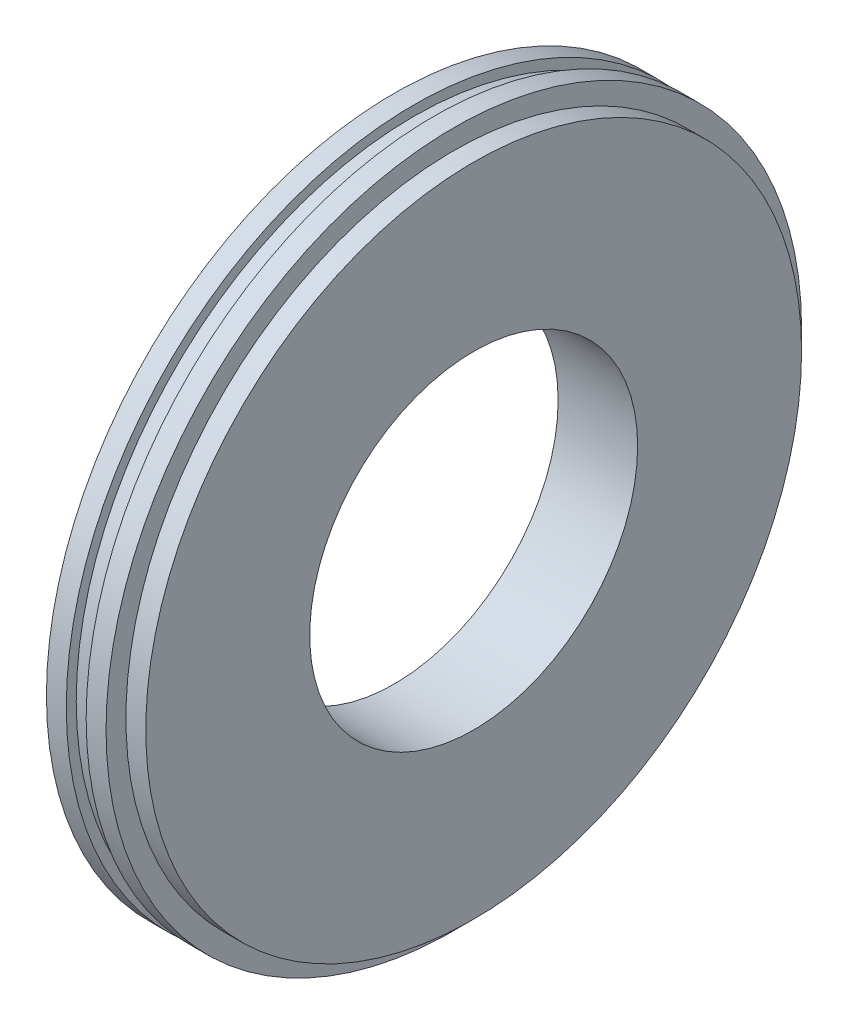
ISO-10303-21;
HEADER;
FILE_DESCRIPTION(('STEP AP214'),'2;1');
FILE_NAME('part.step','',(''),(''),'','','');
FILE_SCHEMA(('AUTOMOTIVE_DESIGN { 1 0 10303 214 1 1 1 1 }'));
ENDSEC;
DATA;
#1=APPLICATION_CONTEXT('core data for automotive mechanical design processes');
#2=APPLICATION_PROTOCOL_DEFINITION('international standard','automotive_design',2000,#1);
#3=PRODUCT_CONTEXT('',#1,'mechanical');
#4=PRODUCT('Part','Part','',(#3));
#5=PRODUCT_RELATED_PRODUCT_CATEGORY('part','',(#4));
#6=PRODUCT_DEFINITION_FORMATION('','',#4);
#7=PRODUCT_DEFINITION_CONTEXT('part definition',#1,'design');
#8=PRODUCT_DEFINITION('design','',#6,#7);
#9=PRODUCT_DEFINITION_SHAPE('','',#8);
#10=(LENGTH_UNIT() NAMED_UNIT(*) SI_UNIT(.MILLI.,.METRE.));
#11=(NAMED_UNIT(*) PLANE_ANGLE_UNIT() SI_UNIT($,.RADIAN.));
#12=(NAMED_UNIT(*) SI_UNIT($,.STERADIAN.) SOLID_ANGLE_UNIT());
#13=UNCERTAINTY_MEASURE_WITH_UNIT(LENGTH_MEASURE(1.E-05),#10,'distance_accuracy_value','');
#14=(GEOMETRIC_REPRESENTATION_CONTEXT(3) GLOBAL_UNCERTAINTY_ASSIGNED_CONTEXT((#13)) GLOBAL_UNIT_ASSIGNED_CONTEXT((#10,
#11,#12)) REPRESENTATION_CONTEXT('',''));
#15=CARTESIAN_POINT('',(0.,0.,0.));
#16=DIRECTION('',(0.,0.,1.));
#17=DIRECTION('',(1.,0.,0.));
#18=AXIS2_PLACEMENT_3D('',#15,#16,#17);
#19=CARTESIAN_POINT('',(8.4,0.,0.));
#20=DIRECTION('',(1.,0.,0.));
#21=DIRECTION('',(0.,0.,-1.));
#22=AXIS2_PLACEMENT_3D('',#19,#20,#21);
#23=CYLINDRICAL_SURFACE('',#22,16.5);
#24=CARTESIAN_POINT('',(8.,0.,0.));
#25=DIRECTION('',(1.,0.,0.));
#26=DIRECTION('',(0.,0.,-1.));
#27=AXIS2_PLACEMENT_3D('',#24,#25,#26);
#28=CIRCLE('',#27,16.5);
#29=CARTESIAN_POINT('',(8.,0.,-16.5));
#30=VERTEX_POINT('',#29);
#31=EDGE_CURVE('E83',#30,#30,#28,.T.);
#32=ORIENTED_EDGE('',*,*,#31,.T.);
#33=EDGE_LOOP('',(#32));
#34=FACE_BOUND('',#33,.T.);
#35=CARTESIAN_POINT('',(0.,0.,0.));
#36=DIRECTION('',(1.,0.,0.));
#37=DIRECTION('',(0.,0.,-1.));
#38=AXIS2_PLACEMENT_3D('',#35,#36,#37);
#39=CIRCLE('',#38,16.5);
#40=CARTESIAN_POINT('',(0.,0.,-16.5));
#41=VERTEX_POINT('',#40);
#42=EDGE_CURVE('E10',#41,#41,#39,.T.);
#43=ORIENTED_EDGE('',*,*,#42,.F.);
#44=EDGE_LOOP('',(#43));
#45=FACE_BOUND('',#44,.T.);
#46=ADVANCED_FACE('F40',(#34,#45),#23,.F.);
#47=CARTESIAN_POINT('',(0.,16.5,0.));
#48=DIRECTION('',(-1.,0.,0.));
#49=DIRECTION('',(0.,0.,1.));
#50=AXIS2_PLACEMENT_3D('',#47,#48,#49);
#51=PLANE('',#50);
#52=ORIENTED_EDGE('',*,*,#42,.T.);
#53=EDGE_LOOP('',(#52));
#54=FACE_BOUND('',#53,.T.);
#55=CARTESIAN_POINT('',(0.,0.,0.));
#56=DIRECTION('',(1.,0.,0.));
#57=DIRECTION('',(0.,0.,-1.));
#58=AXIS2_PLACEMENT_3D('',#55,#56,#57);
#59=CIRCLE('',#58,35.);
#60=CARTESIAN_POINT('',(0.,0.,-35.));
#61=VERTEX_POINT('',#60);
#62=EDGE_CURVE('E47',#61,#61,#59,.T.);
#63=ORIENTED_EDGE('',*,*,#62,.F.);
#64=EDGE_LOOP('',(#63));
#65=FACE_BOUND('',#64,.T.);
#66=ADVANCED_FACE('F102',(#54,#65),#51,.T.);
#67=CARTESIAN_POINT('',(8.4,0.,0.));
#68=DIRECTION('',(1.,0.,0.));
#69=DIRECTION('',(0.,0.,-1.));
#70=AXIS2_PLACEMENT_3D('',#67,#68,#69);
#71=CYLINDRICAL_SURFACE('',#70,35.);
#72=ORIENTED_EDGE('',*,*,#62,.T.);
#73=EDGE_LOOP('',(#72));
#74=FACE_BOUND('',#73,.T.);
#75=CARTESIAN_POINT('',(2.,0.,0.));
#76=DIRECTION('',(1.,0.,0.));
#77=DIRECTION('',(0.,0.,-1.));
#78=AXIS2_PLACEMENT_3D('',#75,#76,#77);
#79=CIRCLE('',#78,35.);
#80=CARTESIAN_POINT('',(2.,0.,-35.));
#81=VERTEX_POINT('',#80);
#82=EDGE_CURVE('E52',#81,#81,#79,.T.);
#83=ORIENTED_EDGE('',*,*,#82,.F.);
#84=EDGE_LOOP('',(#83));
#85=FACE_BOUND('',#84,.T.);
#86=ADVANCED_FACE('F106',(#74,#85),#71,.T.);
#87=CARTESIAN_POINT('',(2.,35.,0.));
#88=DIRECTION('',(1.,0.,0.));
#89=DIRECTION('',(0.,0.,-1.));
#90=AXIS2_PLACEMENT_3D('',#87,#88,#89);
#91=PLANE('',#90);
#92=ORIENTED_EDGE('',*,*,#82,.T.);
#93=EDGE_LOOP('',(#92));
#94=FACE_BOUND('',#93,.T.);
#95=CARTESIAN_POINT('',(2.,0.,0.));
#96=DIRECTION('',(1.,0.,0.));
#97=DIRECTION('',(0.,0.,-1.));
#98=AXIS2_PLACEMENT_3D('',#95,#96,#97);
#99=CIRCLE('',#98,34.);
#100=CARTESIAN_POINT('',(2.,0.,-34.));
#101=VERTEX_POINT('',#100);
#102=EDGE_CURVE('E57',#101,#101,#99,.T.);
#103=ORIENTED_EDGE('',*,*,#102,.F.);
#104=EDGE_LOOP('',(#103));
#105=FACE_BOUND('',#104,.T.);
#106=ADVANCED_FACE('F110',(#94,#105),#91,.T.);
#107=CARTESIAN_POINT('',(8.4,0.,0.));
#108=DIRECTION('',(1.,0.,0.));
#109=DIRECTION('',(0.,0.,-1.));
#110=AXIS2_PLACEMENT_3D('',#107,#108,#109);
#111=CYLINDRICAL_SURFACE('',#110,34.);
#112=ORIENTED_EDGE('',*,*,#102,.T.);
#113=EDGE_LOOP('',(#112));
#114=FACE_BOUND('',#113,.T.);
#115=CARTESIAN_POINT('',(4.,0.,0.));
#116=DIRECTION('',(1.,0.,0.));
#117=DIRECTION('',(0.,0.,-1.));
#118=AXIS2_PLACEMENT_3D('',#115,#116,#117);
#119=CIRCLE('',#118,34.);
#120=CARTESIAN_POINT('',(4.,0.,-34.));
#121=VERTEX_POINT('',#120);
#122=EDGE_CURVE('E63',#121,#121,#119,.T.);
#123=ORIENTED_EDGE('',*,*,#122,.F.);
#124=EDGE_LOOP('',(#123));
#125=FACE_BOUND('',#124,.T.);
#126=ADVANCED_FACE('F116',(#114,#125),#111,.T.);
#127=CARTESIAN_POINT('',(4.,34.,0.));
#128=DIRECTION('',(-1.,0.,0.));
#129=DIRECTION('',(0.,0.,1.));
#130=AXIS2_PLACEMENT_3D('',#127,#128,#129);
#131=PLANE('',#130);
#132=ORIENTED_EDGE('',*,*,#122,.T.);
#133=EDGE_LOOP('',(#132));
#134=FACE_BOUND('',#133,.T.);
#135=CARTESIAN_POINT('',(4.,0.,0.));
#136=DIRECTION('',(1.,0.,0.));
#137=DIRECTION('',(0.,0.,-1.));
#138=AXIS2_PLACEMENT_3D('',#135,#136,#137);
#139=CIRCLE('',#138,35.);
#140=CARTESIAN_POINT('',(4.,0.,-35.));
#141=VERTEX_POINT('',#140);
#142=EDGE_CURVE('E67',#141,#141,#139,.T.);
#143=ORIENTED_EDGE('',*,*,#142,.F.);
#144=EDGE_LOOP('',(#143));
#145=FACE_BOUND('',#144,.T.);
#146=ADVANCED_FACE('F120',(#134,#145),#131,.T.);
#147=CARTESIAN_POINT('',(8.4,0.,0.));
#148=DIRECTION('',(1.,0.,0.));
#149=DIRECTION('',(0.,0.,-1.));
#150=AXIS2_PLACEMENT_3D('',#147,#148,#149);
#151=CYLINDRICAL_SURFACE('',#150,35.);
#152=ORIENTED_EDGE('',*,*,#142,.T.);
#153=EDGE_LOOP('',(#152));
#154=FACE_BOUND('',#153,.T.);
#155=CARTESIAN_POINT('',(6.,0.,0.));
#156=DIRECTION('',(1.,0.,0.));
#157=DIRECTION('',(0.,0.,-1.));
#158=AXIS2_PLACEMENT_3D('',#155,#156,#157);
#159=CIRCLE('',#158,35.);
#160=CARTESIAN_POINT('',(6.,0.,-35.));
#161=VERTEX_POINT('',#160);
#162=EDGE_CURVE('E71',#161,#161,#159,.T.);
#163=ORIENTED_EDGE('',*,*,#162,.F.);
#164=EDGE_LOOP('',(#163));
#165=FACE_BOUND('',#164,.T.);
#166=ADVANCED_FACE('F124',(#154,#165),#151,.T.);
#167=CARTESIAN_POINT('',(6.,35.,0.));
#168=DIRECTION('',(1.,0.,0.));
#169=DIRECTION('',(0.,0.,-1.));
#170=AXIS2_PLACEMENT_3D('',#167,#168,#169);
#171=PLANE('',#170);
#172=ORIENTED_EDGE('',*,*,#162,.T.);
#173=EDGE_LOOP('',(#172));
#174=FACE_BOUND('',#173,.T.);
#175=CARTESIAN_POINT('',(6.,0.,0.));
#176=DIRECTION('',(1.,0.,0.));
#177=DIRECTION('',(0.,0.,-1.));
#178=AXIS2_PLACEMENT_3D('',#175,#176,#177);
#179=CIRCLE('',#178,33.);
#180=CARTESIAN_POINT('',(6.,0.,-33.));
#181=VERTEX_POINT('',#180);
#182=EDGE_CURVE('E75',#181,#181,#179,.T.);
#183=ORIENTED_EDGE('',*,*,#182,.F.);
#184=EDGE_LOOP('',(#183));
#185=FACE_BOUND('',#184,.T.);
#186=ADVANCED_FACE('F98',(#174,#185),#171,.T.);
#187=CARTESIAN_POINT('',(8.4,0.,0.));
#188=DIRECTION('',(1.,0.,0.));
#189=DIRECTION('',(0.,0.,-1.));
#190=AXIS2_PLACEMENT_3D('',#187,#188,#189);
#191=CYLINDRICAL_SURFACE('',#190,33.);
#192=ORIENTED_EDGE('',*,*,#182,.T.);
#193=EDGE_LOOP('',(#192));
#194=FACE_BOUND('',#193,.T.);
#195=CARTESIAN_POINT('',(8.,0.,0.));
#196=DIRECTION('',(1.,0.,0.));
#197=DIRECTION('',(0.,0.,-1.));
#198=AXIS2_PLACEMENT_3D('',#195,#196,#197);
#199=CIRCLE('',#198,33.);
#200=CARTESIAN_POINT('',(8.,0.,-33.));
#201=VERTEX_POINT('',#200);
#202=EDGE_CURVE('E79',#201,#201,#199,.T.);
#203=ORIENTED_EDGE('',*,*,#202,.F.);
#204=EDGE_LOOP('',(#203));
#205=FACE_BOUND('',#204,.T.);
#206=ADVANCED_FACE('F92',(#194,#205),#191,.T.);
#207=CARTESIAN_POINT('',(8.,33.,0.));
#208=DIRECTION('',(1.,0.,0.));
#209=DIRECTION('',(0.,0.,-1.));
#210=AXIS2_PLACEMENT_3D('',#207,#208,#209);
#211=PLANE('',#210);
#212=ORIENTED_EDGE('',*,*,#202,.T.);
#213=EDGE_LOOP('',(#212));
#214=FACE_BOUND('',#213,.T.);
#215=ORIENTED_EDGE('',*,*,#31,.F.);
#216=EDGE_LOOP('',(#215));
#217=FACE_BOUND('',#216,.T.);
#218=ADVANCED_FACE('F90',(#214,#217),#211,.T.);
#219=CLOSED_SHELL('',(#46,#66,#86,#106,#126,#146,#166,#186,#206,#218));
#220=MANIFOLD_SOLID_BREP('B2',#219);
#221=ADVANCED_BREP_SHAPE_REPRESENTATION('',(#18,#220),#14);
#222=SHAPE_DEFINITION_REPRESENTATION(#9,#221);
ENDSEC;
END-ISO-10303-21;
